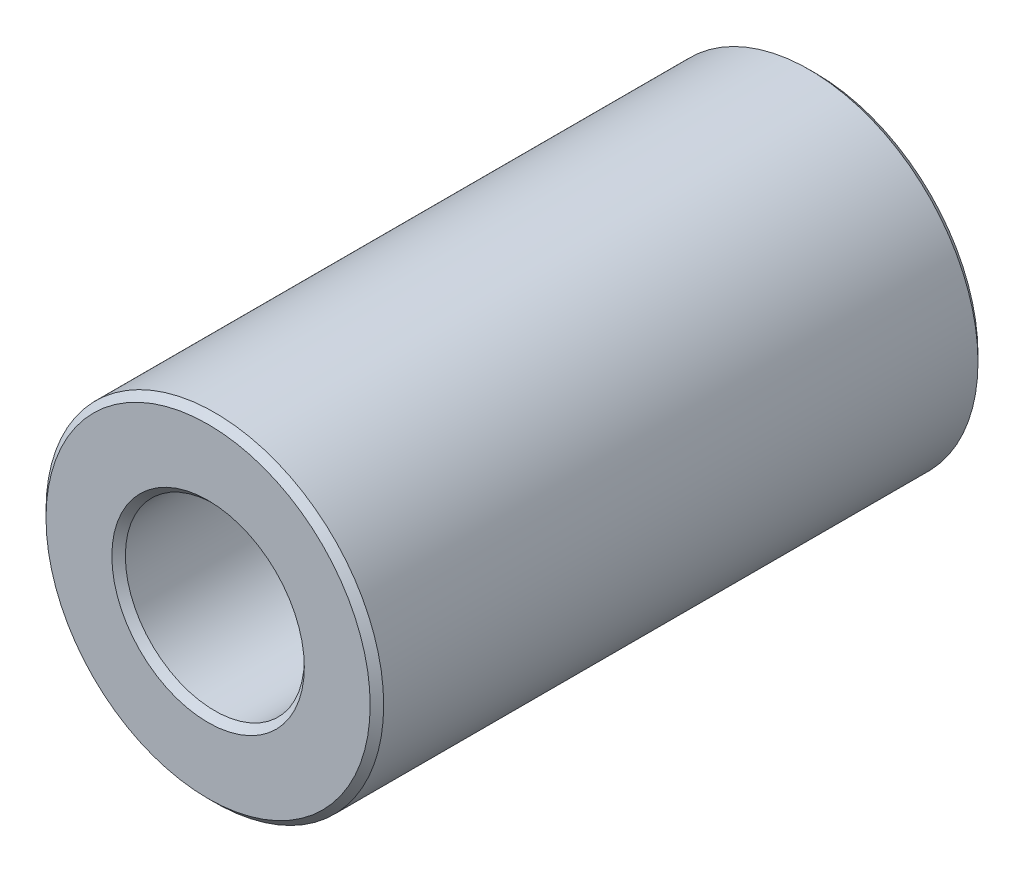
ISO-10303-21;
HEADER;
FILE_DESCRIPTION(('STEP AP214'),'2;1');
FILE_NAME('part.step','',(''),(''),'','','');
FILE_SCHEMA(('AUTOMOTIVE_DESIGN { 1 0 10303 214 1 1 1 1 }'));
ENDSEC;
DATA;
#1=APPLICATION_CONTEXT('core data for automotive mechanical design processes');
#2=APPLICATION_PROTOCOL_DEFINITION('international standard','automotive_design',2000,#1);
#3=PRODUCT_CONTEXT('',#1,'mechanical');
#4=PRODUCT('Part','Part','',(#3));
#5=PRODUCT_RELATED_PRODUCT_CATEGORY('part','',(#4));
#6=PRODUCT_DEFINITION_FORMATION('','',#4);
#7=PRODUCT_DEFINITION_CONTEXT('part definition',#1,'design');
#8=PRODUCT_DEFINITION('design','',#6,#7);
#9=PRODUCT_DEFINITION_SHAPE('','',#8);
#10=(LENGTH_UNIT() NAMED_UNIT(*) SI_UNIT(.MILLI.,.METRE.));
#11=(NAMED_UNIT(*) PLANE_ANGLE_UNIT() SI_UNIT($,.RADIAN.));
#12=(NAMED_UNIT(*) SI_UNIT($,.STERADIAN.) SOLID_ANGLE_UNIT());
#13=UNCERTAINTY_MEASURE_WITH_UNIT(LENGTH_MEASURE(1.E-05),#10,'distance_accuracy_value','');
#14=(GEOMETRIC_REPRESENTATION_CONTEXT(3) GLOBAL_UNCERTAINTY_ASSIGNED_CONTEXT((#13)) GLOBAL_UNIT_ASSIGNED_CONTEXT((#10,
#11,#12)) REPRESENTATION_CONTEXT('',''));
#15=CARTESIAN_POINT('',(0.,0.,0.));
#16=DIRECTION('',(0.,0.,1.));
#17=DIRECTION('',(1.,0.,0.));
#18=AXIS2_PLACEMENT_3D('',#15,#16,#17);
#19=CARTESIAN_POINT('',(0.,0.,9.));
#20=DIRECTION('',(0.,0.,1.));
#21=DIRECTION('',(1.,0.,0.));
#22=AXIS2_PLACEMENT_3D('',#19,#20,#21);
#23=PLANE('',#22);
#24=CARTESIAN_POINT('',(0.,0.,9.));
#25=DIRECTION('',(0.,0.,1.));
#26=DIRECTION('',(1.,0.,0.));
#27=AXIS2_PLACEMENT_3D('',#24,#25,#26);
#28=CIRCLE('',#27,2.85);
#29=CARTESIAN_POINT('',(2.85,0.,9.));
#30=VERTEX_POINT('',#29);
#31=EDGE_CURVE('E10',#30,#30,#28,.F.);
#32=ORIENTED_EDGE('',*,*,#31,.T.);
#33=EDGE_LOOP('',(#32));
#34=FACE_BOUND('',#33,.T.);
#35=CARTESIAN_POINT('',(0.,0.,9.));
#36=DIRECTION('',(0.,0.,1.));
#37=DIRECTION('',(1.,0.,0.));
#38=AXIS2_PLACEMENT_3D('',#35,#36,#37);
#39=CIRCLE('',#38,4.79999999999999);
#40=CARTESIAN_POINT('',(4.79999999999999,0.,9.));
#41=VERTEX_POINT('',#40);
#42=EDGE_CURVE('E45',#41,#41,#39,.T.);
#43=ORIENTED_EDGE('',*,*,#42,.T.);
#44=EDGE_LOOP('',(#43));
#45=FACE_BOUND('',#44,.T.);
#46=ADVANCED_FACE('F37',(#34,#45),#23,.T.);
#47=CARTESIAN_POINT('',(0.,0.,-9.));
#48=DIRECTION('',(0.,0.,1.));
#49=DIRECTION('',(1.,0.,0.));
#50=AXIS2_PLACEMENT_3D('',#47,#48,#49);
#51=PLANE('',#50);
#52=CARTESIAN_POINT('',(0.,0.,-9.));
#53=DIRECTION('',(0.,0.,1.));
#54=DIRECTION('',(1.,0.,0.));
#55=AXIS2_PLACEMENT_3D('',#52,#53,#54);
#56=CIRCLE('',#55,4.8);
#57=CARTESIAN_POINT('',(4.8,0.,-9.));
#58=VERTEX_POINT('',#57);
#59=EDGE_CURVE('E65',#58,#58,#56,.F.);
#60=ORIENTED_EDGE('',*,*,#59,.T.);
#61=EDGE_LOOP('',(#60));
#62=FACE_BOUND('',#61,.T.);
#63=CARTESIAN_POINT('',(0.,0.,-9.));
#64=DIRECTION('',(0.,0.,1.));
#65=DIRECTION('',(1.,0.,0.));
#66=AXIS2_PLACEMENT_3D('',#63,#64,#65);
#67=CIRCLE('',#66,2.85);
#68=CARTESIAN_POINT('',(2.85,0.,-9.));
#69=VERTEX_POINT('',#68);
#70=EDGE_CURVE('E68',#69,#69,#67,.T.);
#71=ORIENTED_EDGE('',*,*,#70,.T.);
#72=EDGE_LOOP('',(#71));
#73=FACE_BOUND('',#72,.T.);
#74=ADVANCED_FACE('F89',(#62,#73),#51,.F.);
#75=CARTESIAN_POINT('',(0.,0.,9.));
#76=DIRECTION('',(0.,0.,-1.));
#77=DIRECTION('',(-1.,0.,0.));
#78=AXIS2_PLACEMENT_3D('',#75,#76,#77);
#79=CYLINDRICAL_SURFACE('',#78,5.);
#80=CARTESIAN_POINT('',(0.,0.,-8.8));
#81=DIRECTION('',(0.,0.,1.));
#82=DIRECTION('',(1.,0.,0.));
#83=AXIS2_PLACEMENT_3D('',#80,#81,#82);
#84=CIRCLE('',#83,5.);
#85=CARTESIAN_POINT('',(5.,0.,-8.8));
#86=VERTEX_POINT('',#85);
#87=EDGE_CURVE('E71',#86,#86,#84,.T.);
#88=ORIENTED_EDGE('',*,*,#87,.T.);
#89=EDGE_LOOP('',(#88));
#90=FACE_BOUND('',#89,.T.);
#91=CARTESIAN_POINT('',(0.,0.,8.79999999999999));
#92=DIRECTION('',(0.,0.,1.));
#93=DIRECTION('',(1.,0.,0.));
#94=AXIS2_PLACEMENT_3D('',#91,#92,#93);
#95=CIRCLE('',#94,5.);
#96=CARTESIAN_POINT('',(5.,0.,8.79999999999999));
#97=VERTEX_POINT('',#96);
#98=EDGE_CURVE('E74',#97,#97,#95,.F.);
#99=ORIENTED_EDGE('',*,*,#98,.T.);
#100=EDGE_LOOP('',(#99));
#101=FACE_BOUND('',#100,.T.);
#102=ADVANCED_FACE('F78',(#90,#101),#79,.T.);
#103=CARTESIAN_POINT('',(0.,0.,9.));
#104=DIRECTION('',(0.,0.,-1.));
#105=DIRECTION('',(-1.,0.,0.));
#106=AXIS2_PLACEMENT_3D('',#103,#104,#105);
#107=CYLINDRICAL_SURFACE('',#106,2.65);
#108=CARTESIAN_POINT('',(0.,0.,-8.79999999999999));
#109=DIRECTION('',(0.,0.,1.));
#110=DIRECTION('',(1.,0.,0.));
#111=AXIS2_PLACEMENT_3D('',#108,#109,#110);
#112=CIRCLE('',#111,2.65);
#113=CARTESIAN_POINT('',(2.65,0.,-8.79999999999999));
#114=VERTEX_POINT('',#113);
#115=EDGE_CURVE('E52',#114,#114,#112,.F.);
#116=ORIENTED_EDGE('',*,*,#115,.T.);
#117=EDGE_LOOP('',(#116));
#118=FACE_BOUND('',#117,.T.);
#119=CARTESIAN_POINT('',(0.,0.,8.8));
#120=DIRECTION('',(0.,0.,1.));
#121=DIRECTION('',(1.,0.,0.));
#122=AXIS2_PLACEMENT_3D('',#119,#120,#121);
#123=CIRCLE('',#122,2.65);
#124=CARTESIAN_POINT('',(2.65,0.,8.8));
#125=VERTEX_POINT('',#124);
#126=EDGE_CURVE('E59',#125,#125,#123,.T.);
#127=ORIENTED_EDGE('',*,*,#126,.T.);
#128=EDGE_LOOP('',(#127));
#129=FACE_BOUND('',#128,.T.);
#130=ADVANCED_FACE('F97',(#118,#129),#107,.F.);
#131=CARTESIAN_POINT('',(0.,0.,-8.8));
#132=DIRECTION('',(0.,0.,1.));
#133=DIRECTION('',(1.,0.,0.));
#134=AXIS2_PLACEMENT_3D('',#131,#132,#133);
#135=CONICAL_SURFACE('',#134,5.,0.785398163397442);
#136=ORIENTED_EDGE('',*,*,#59,.F.);
#137=EDGE_LOOP('',(#136));
#138=FACE_BOUND('',#137,.T.);
#139=ORIENTED_EDGE('',*,*,#87,.F.);
#140=EDGE_LOOP('',(#139));
#141=FACE_BOUND('',#140,.T.);
#142=ADVANCED_FACE('F102',(#138,#141),#135,.T.);
#143=CARTESIAN_POINT('',(0.,0.,-9.));
#144=DIRECTION('',(0.,0.,-1.));
#145=DIRECTION('',(-1.,0.,0.));
#146=AXIS2_PLACEMENT_3D('',#143,#144,#145);
#147=CONICAL_SURFACE('',#146,2.85,0.785398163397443);
#148=ORIENTED_EDGE('',*,*,#115,.F.);
#149=EDGE_LOOP('',(#148));
#150=FACE_BOUND('',#149,.T.);
#151=ORIENTED_EDGE('',*,*,#70,.F.);
#152=EDGE_LOOP('',(#151));
#153=FACE_BOUND('',#152,.T.);
#154=ADVANCED_FACE('F86',(#150,#153),#147,.F.);
#155=CARTESIAN_POINT('',(0.,0.,8.8));
#156=DIRECTION('',(0.,0.,1.));
#157=DIRECTION('',(1.,0.,0.));
#158=AXIS2_PLACEMENT_3D('',#155,#156,#157);
#159=CONICAL_SURFACE('',#158,2.65,0.785398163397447);
#160=ORIENTED_EDGE('',*,*,#31,.F.);
#161=EDGE_LOOP('',(#160));
#162=FACE_BOUND('',#161,.T.);
#163=ORIENTED_EDGE('',*,*,#126,.F.);
#164=EDGE_LOOP('',(#163));
#165=FACE_BOUND('',#164,.T.);
#166=ADVANCED_FACE('F82',(#162,#165),#159,.F.);
#167=CARTESIAN_POINT('',(0.,0.,9.));
#168=DIRECTION('',(0.,0.,-1.));
#169=DIRECTION('',(-1.,0.,0.));
#170=AXIS2_PLACEMENT_3D('',#167,#168,#169);
#171=CONICAL_SURFACE('',#170,4.79999999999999,0.78539816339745);
#172=ORIENTED_EDGE('',*,*,#98,.F.);
#173=EDGE_LOOP('',(#172));
#174=FACE_BOUND('',#173,.T.);
#175=ORIENTED_EDGE('',*,*,#42,.F.);
#176=EDGE_LOOP('',(#175));
#177=FACE_BOUND('',#176,.T.);
#178=ADVANCED_FACE('F39',(#174,#177),#171,.T.);
#179=CLOSED_SHELL('',(#46,#74,#102,#130,#142,#154,#166,#178));
#180=MANIFOLD_SOLID_BREP('B2',#179);
#181=ADVANCED_BREP_SHAPE_REPRESENTATION('',(#18,#180),#14);
#182=SHAPE_DEFINITION_REPRESENTATION(#9,#181);
ENDSEC;
END-ISO-10303-21;
